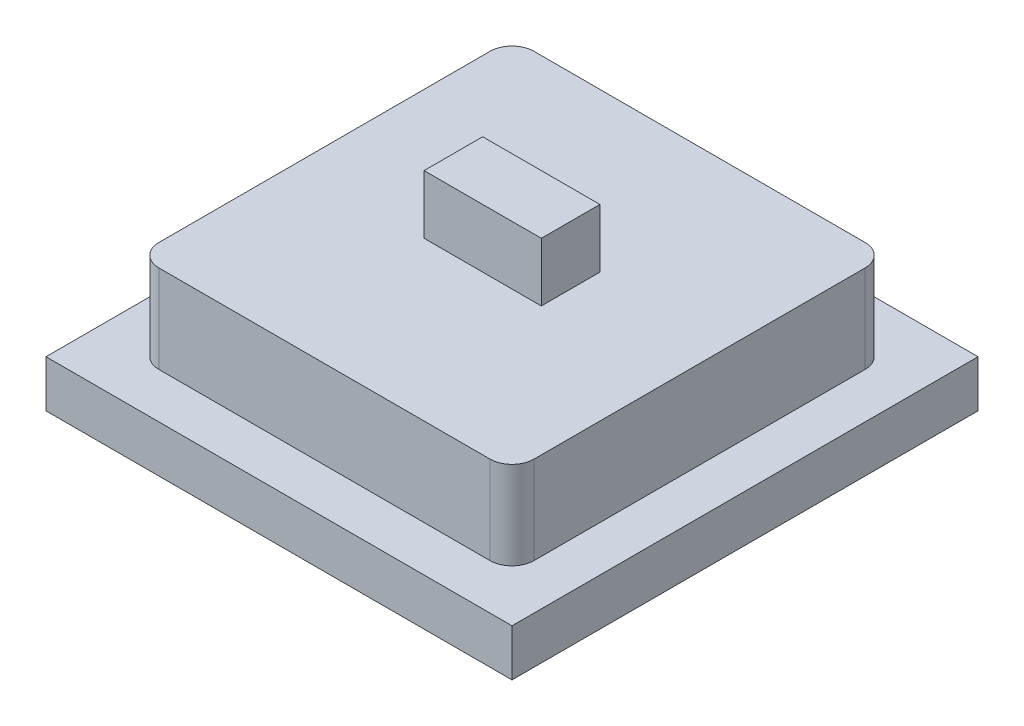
ISO-10303-21;
HEADER;
FILE_DESCRIPTION(('STEP AP214'),'2;1');
FILE_NAME('part.step','',(''),(''),'','','');
FILE_SCHEMA(('AUTOMOTIVE_DESIGN { 1 0 10303 214 1 1 1 1 }'));
ENDSEC;
DATA;
#1=APPLICATION_CONTEXT('core data for automotive mechanical design processes');
#2=APPLICATION_PROTOCOL_DEFINITION('international standard','automotive_design',2000,#1);
#3=PRODUCT_CONTEXT('',#1,'mechanical');
#4=PRODUCT('Part','Part','',(#3));
#5=PRODUCT_RELATED_PRODUCT_CATEGORY('part','',(#4));
#6=PRODUCT_DEFINITION_FORMATION('','',#4);
#7=PRODUCT_DEFINITION_CONTEXT('part definition',#1,'design');
#8=PRODUCT_DEFINITION('design','',#6,#7);
#9=PRODUCT_DEFINITION_SHAPE('','',#8);
#10=(LENGTH_UNIT() NAMED_UNIT(*) SI_UNIT(.MILLI.,.METRE.));
#11=(NAMED_UNIT(*) PLANE_ANGLE_UNIT() SI_UNIT($,.RADIAN.));
#12=(NAMED_UNIT(*) SI_UNIT($,.STERADIAN.) SOLID_ANGLE_UNIT());
#13=UNCERTAINTY_MEASURE_WITH_UNIT(LENGTH_MEASURE(1.E-05),#10,'distance_accuracy_value','');
#14=(GEOMETRIC_REPRESENTATION_CONTEXT(3) GLOBAL_UNCERTAINTY_ASSIGNED_CONTEXT((#13)) GLOBAL_UNIT_ASSIGNED_CONTEXT((#10,
#11,#12)) REPRESENTATION_CONTEXT('',''));
#15=CARTESIAN_POINT('',(0.,0.,0.));
#16=DIRECTION('',(0.,0.,1.));
#17=DIRECTION('',(1.,0.,0.));
#18=AXIS2_PLACEMENT_3D('',#15,#16,#17);
#19=CARTESIAN_POINT('',(-5.65,3.,-5.65));
#20=DIRECTION('',(0.,-1.,0.));
#21=DIRECTION('',(0.,0.,-1.));
#22=AXIS2_PLACEMENT_3D('',#19,#20,#21);
#23=PLANE('',#22);
#24=CARTESIAN_POINT('',(-5.65,3.,-5.65));
#25=DIRECTION('',(0.,1.,0.));
#26=DIRECTION('',(0.,0.,-1.));
#27=AXIS2_PLACEMENT_3D('',#24,#25,#26);
#28=CIRCLE('',#27,0.750000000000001);
#29=CARTESIAN_POINT('',(-5.65,3.,-6.4));
#30=VERTEX_POINT('',#29);
#31=CARTESIAN_POINT('',(-6.4,3.,-5.65));
#32=VERTEX_POINT('',#31);
#33=EDGE_CURVE('E202',#30,#32,#28,.T.);
#34=ORIENTED_EDGE('',*,*,#33,.T.);
#35=DIRECTION('',(0.,0.,1.));
#36=VECTOR('',#35,1.);
#37=CARTESIAN_POINT('',(-6.4,3.,5.65));
#38=LINE('',#37,#36);
#39=CARTESIAN_POINT('',(-6.4,3.,5.65));
#40=VERTEX_POINT('',#39);
#41=EDGE_CURVE('E205',#32,#40,#38,.T.);
#42=ORIENTED_EDGE('',*,*,#41,.T.);
#43=CARTESIAN_POINT('',(-5.65,3.,5.65));
#44=DIRECTION('',(0.,1.,0.));
#45=DIRECTION('',(0.,0.,-1.));
#46=AXIS2_PLACEMENT_3D('',#43,#44,#45);
#47=CIRCLE('',#46,0.750000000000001);
#48=CARTESIAN_POINT('',(-5.65,3.,6.4));
#49=VERTEX_POINT('',#48);
#50=EDGE_CURVE('E208',#40,#49,#47,.T.);
#51=ORIENTED_EDGE('',*,*,#50,.T.);
#52=DIRECTION('',(1.,0.,0.));
#53=VECTOR('',#52,1.);
#54=CARTESIAN_POINT('',(-5.65,3.,6.4));
#55=LINE('',#54,#53);
#56=CARTESIAN_POINT('',(5.65,3.,6.4));
#57=VERTEX_POINT('',#56);
#58=EDGE_CURVE('E210',#49,#57,#55,.T.);
#59=ORIENTED_EDGE('',*,*,#58,.T.);
#60=CARTESIAN_POINT('',(5.65,3.,5.65));
#61=DIRECTION('',(0.,1.,0.));
#62=DIRECTION('',(0.,0.,1.));
#63=AXIS2_PLACEMENT_3D('',#60,#61,#62);
#64=CIRCLE('',#63,0.750000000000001);
#65=CARTESIAN_POINT('',(6.4,3.,5.65));
#66=VERTEX_POINT('',#65);
#67=EDGE_CURVE('E212',#57,#66,#64,.T.);
#68=ORIENTED_EDGE('',*,*,#67,.T.);
#69=DIRECTION('',(0.,0.,-1.));
#70=VECTOR('',#69,1.);
#71=CARTESIAN_POINT('',(6.4,3.,5.65));
#72=LINE('',#71,#70);
#73=CARTESIAN_POINT('',(6.4,3.,-5.65));
#74=VERTEX_POINT('',#73);
#75=EDGE_CURVE('E214',#66,#74,#72,.T.);
#76=ORIENTED_EDGE('',*,*,#75,.T.);
#77=CARTESIAN_POINT('',(5.65,3.,-5.65));
#78=DIRECTION('',(0.,1.,0.));
#79=DIRECTION('',(0.,0.,-1.));
#80=AXIS2_PLACEMENT_3D('',#77,#78,#79);
#81=CIRCLE('',#80,0.750000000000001);
#82=CARTESIAN_POINT('',(5.65,3.,-6.4));
#83=VERTEX_POINT('',#82);
#84=EDGE_CURVE('E216',#74,#83,#81,.T.);
#85=ORIENTED_EDGE('',*,*,#84,.T.);
#86=DIRECTION('',(-1.,0.,0.));
#87=VECTOR('',#86,1.);
#88=CARTESIAN_POINT('',(-5.65,3.,-6.4));
#89=LINE('',#88,#87);
#90=EDGE_CURVE('E218',#83,#30,#89,.T.);
#91=ORIENTED_EDGE('',*,*,#90,.T.);
#92=EDGE_LOOP('',(#34,#42,#51,#59,#68,#76,#85,#91));
#93=FACE_BOUND('',#92,.T.);
#94=DIRECTION('',(0.,0.,1.));
#95=VECTOR('',#94,1.);
#96=CARTESIAN_POINT('',(-2.,3.,1.));
#97=LINE('',#96,#95);
#98=CARTESIAN_POINT('',(-2.,3.,-1.));
#99=VERTEX_POINT('',#98);
#100=CARTESIAN_POINT('',(-2.,3.,1.));
#101=VERTEX_POINT('',#100);
#102=EDGE_CURVE('E48',#99,#101,#97,.T.);
#103=ORIENTED_EDGE('',*,*,#102,.F.);
#104=DIRECTION('',(-1.,0.,0.));
#105=VECTOR('',#104,1.);
#106=CARTESIAN_POINT('',(2.,3.,-1.));
#107=LINE('',#106,#105);
#108=CARTESIAN_POINT('',(2.,3.,-1.));
#109=VERTEX_POINT('',#108);
#110=EDGE_CURVE('E52',#109,#99,#107,.T.);
#111=ORIENTED_EDGE('',*,*,#110,.F.);
#112=DIRECTION('',(0.,0.,-1.));
#113=VECTOR('',#112,1.);
#114=CARTESIAN_POINT('',(2.,3.,1.));
#115=LINE('',#114,#113);
#116=CARTESIAN_POINT('',(2.,3.,1.));
#117=VERTEX_POINT('',#116);
#118=EDGE_CURVE('E479',#117,#109,#115,.T.);
#119=ORIENTED_EDGE('',*,*,#118,.F.);
#120=DIRECTION('',(1.,0.,0.));
#121=VECTOR('',#120,1.);
#122=CARTESIAN_POINT('',(2.,3.,1.));
#123=LINE('',#122,#121);
#124=EDGE_CURVE('E485',#101,#117,#123,.T.);
#125=ORIENTED_EDGE('',*,*,#124,.F.);
#126=EDGE_LOOP('',(#103,#111,#119,#125));
#127=FACE_BOUND('',#126,.T.);
#128=ADVANCED_FACE('F33',(#93,#127),#23,.F.);
#129=CARTESIAN_POINT('',(-5.65,3.,-5.65));
#130=DIRECTION('',(0.,-1.,0.));
#131=DIRECTION('',(0.,0.,-1.));
#132=AXIS2_PLACEMENT_3D('',#129,#130,#131);
#133=CYLINDRICAL_SURFACE('',#132,0.750000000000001);
#134=CARTESIAN_POINT('',(-5.65,0.,-5.65));
#135=DIRECTION('',(0.,1.,0.));
#136=DIRECTION('',(0.,0.,-1.));
#137=AXIS2_PLACEMENT_3D('',#134,#135,#136);
#138=CIRCLE('',#137,0.750000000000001);
#139=CARTESIAN_POINT('',(-5.65,0.,-6.4));
#140=VERTEX_POINT('',#139);
#141=CARTESIAN_POINT('',(-6.4,0.,-5.65));
#142=VERTEX_POINT('',#141);
#143=EDGE_CURVE('E201',#140,#142,#138,.T.);
#144=ORIENTED_EDGE('',*,*,#143,.T.);
#145=DIRECTION('',(0.,-1.,0.));
#146=VECTOR('',#145,1.);
#147=CARTESIAN_POINT('',(-6.4,3.,-5.65));
#148=LINE('',#147,#146);
#149=EDGE_CURVE('E11',#32,#142,#148,.T.);
#150=ORIENTED_EDGE('',*,*,#149,.F.);
#151=ORIENTED_EDGE('',*,*,#33,.F.);
#152=DIRECTION('',(0.,-1.,0.));
#153=VECTOR('',#152,1.);
#154=CARTESIAN_POINT('',(-5.65,3.,-6.4));
#155=LINE('',#154,#153);
#156=EDGE_CURVE('E220',#30,#140,#155,.T.);
#157=ORIENTED_EDGE('',*,*,#156,.T.);
#158=EDGE_LOOP('',(#144,#150,#151,#157));
#159=FACE_BOUND('',#158,.T.);
#160=ADVANCED_FACE('F35',(#159),#133,.T.);
#161=CARTESIAN_POINT('',(-6.4,3.,5.65));
#162=DIRECTION('',(1.,0.,0.));
#163=DIRECTION('',(0.,0.,-1.));
#164=AXIS2_PLACEMENT_3D('',#161,#162,#163);
#165=PLANE('',#164);
#166=DIRECTION('',(0.,0.,1.));
#167=VECTOR('',#166,1.);
#168=CARTESIAN_POINT('',(-6.4,0.,5.65));
#169=LINE('',#168,#167);
#170=CARTESIAN_POINT('',(-6.4,0.,5.65));
#171=VERTEX_POINT('',#170);
#172=EDGE_CURVE('E223',#142,#171,#169,.T.);
#173=ORIENTED_EDGE('',*,*,#172,.T.);
#174=DIRECTION('',(0.,-1.,0.));
#175=VECTOR('',#174,1.);
#176=CARTESIAN_POINT('',(-6.4,3.,5.65));
#177=LINE('',#176,#175);
#178=EDGE_CURVE('E41',#40,#171,#177,.T.);
#179=ORIENTED_EDGE('',*,*,#178,.F.);
#180=ORIENTED_EDGE('',*,*,#41,.F.);
#181=ORIENTED_EDGE('',*,*,#149,.T.);
#182=EDGE_LOOP('',(#173,#179,#180,#181));
#183=FACE_BOUND('',#182,.T.);
#184=ADVANCED_FACE('F266',(#183),#165,.F.);
#185=CARTESIAN_POINT('',(-5.65,3.,5.65));
#186=DIRECTION('',(0.,-1.,0.));
#187=DIRECTION('',(0.,0.,-1.));
#188=AXIS2_PLACEMENT_3D('',#185,#186,#187);
#189=CYLINDRICAL_SURFACE('',#188,0.750000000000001);
#190=CARTESIAN_POINT('',(-5.65,0.,5.65));
#191=DIRECTION('',(0.,1.,0.));
#192=DIRECTION('',(0.,0.,-1.));
#193=AXIS2_PLACEMENT_3D('',#190,#191,#192);
#194=CIRCLE('',#193,0.750000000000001);
#195=CARTESIAN_POINT('',(-5.65,0.,6.4));
#196=VERTEX_POINT('',#195);
#197=EDGE_CURVE('E226',#171,#196,#194,.T.);
#198=ORIENTED_EDGE('',*,*,#197,.T.);
#199=DIRECTION('',(0.,-1.,0.));
#200=VECTOR('',#199,1.);
#201=CARTESIAN_POINT('',(-5.65,3.,6.4));
#202=LINE('',#201,#200);
#203=EDGE_CURVE('E257',#49,#196,#202,.T.);
#204=ORIENTED_EDGE('',*,*,#203,.F.);
#205=ORIENTED_EDGE('',*,*,#50,.F.);
#206=ORIENTED_EDGE('',*,*,#178,.T.);
#207=EDGE_LOOP('',(#198,#204,#205,#206));
#208=FACE_BOUND('',#207,.T.);
#209=ADVANCED_FACE('F263',(#208),#189,.T.);
#210=CARTESIAN_POINT('',(-5.65,3.,6.4));
#211=DIRECTION('',(0.,0.,-1.));
#212=DIRECTION('',(-1.,0.,0.));
#213=AXIS2_PLACEMENT_3D('',#210,#211,#212);
#214=PLANE('',#213);
#215=DIRECTION('',(1.,0.,0.));
#216=VECTOR('',#215,1.);
#217=CARTESIAN_POINT('',(-5.65,0.,6.4));
#218=LINE('',#217,#216);
#219=CARTESIAN_POINT('',(5.65,0.,6.4));
#220=VERTEX_POINT('',#219);
#221=EDGE_CURVE('E229',#196,#220,#218,.T.);
#222=ORIENTED_EDGE('',*,*,#221,.T.);
#223=DIRECTION('',(0.,-1.,0.));
#224=VECTOR('',#223,1.);
#225=CARTESIAN_POINT('',(5.65,3.,6.4));
#226=LINE('',#225,#224);
#227=EDGE_CURVE('E254',#57,#220,#226,.T.);
#228=ORIENTED_EDGE('',*,*,#227,.F.);
#229=ORIENTED_EDGE('',*,*,#58,.F.);
#230=ORIENTED_EDGE('',*,*,#203,.T.);
#231=EDGE_LOOP('',(#222,#228,#229,#230));
#232=FACE_BOUND('',#231,.T.);
#233=ADVANCED_FACE('F272',(#232),#214,.F.);
#234=CARTESIAN_POINT('',(5.65,3.,5.65));
#235=DIRECTION('',(0.,-1.,0.));
#236=DIRECTION('',(0.,0.,-1.));
#237=AXIS2_PLACEMENT_3D('',#234,#235,#236);
#238=CYLINDRICAL_SURFACE('',#237,0.750000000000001);
#239=CARTESIAN_POINT('',(5.65,0.,5.65));
#240=DIRECTION('',(0.,1.,0.));
#241=DIRECTION('',(0.,0.,1.));
#242=AXIS2_PLACEMENT_3D('',#239,#240,#241);
#243=CIRCLE('',#242,0.750000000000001);
#244=CARTESIAN_POINT('',(6.4,0.,5.65));
#245=VERTEX_POINT('',#244);
#246=EDGE_CURVE('E232',#220,#245,#243,.T.);
#247=ORIENTED_EDGE('',*,*,#246,.T.);
#248=DIRECTION('',(0.,-1.,0.));
#249=VECTOR('',#248,1.);
#250=CARTESIAN_POINT('',(6.4,3.,5.65));
#251=LINE('',#250,#249);
#252=EDGE_CURVE('E251',#66,#245,#251,.T.);
#253=ORIENTED_EDGE('',*,*,#252,.F.);
#254=ORIENTED_EDGE('',*,*,#67,.F.);
#255=ORIENTED_EDGE('',*,*,#227,.T.);
#256=EDGE_LOOP('',(#247,#253,#254,#255));
#257=FACE_BOUND('',#256,.T.);
#258=ADVANCED_FACE('F276',(#257),#238,.T.);
#259=CARTESIAN_POINT('',(6.4,3.,5.65));
#260=DIRECTION('',(-1.,0.,0.));
#261=DIRECTION('',(0.,0.,1.));
#262=AXIS2_PLACEMENT_3D('',#259,#260,#261);
#263=PLANE('',#262);
#264=DIRECTION('',(0.,0.,-1.));
#265=VECTOR('',#264,1.);
#266=CARTESIAN_POINT('',(6.4,0.,5.65));
#267=LINE('',#266,#265);
#268=CARTESIAN_POINT('',(6.4,0.,-5.65));
#269=VERTEX_POINT('',#268);
#270=EDGE_CURVE('E235',#245,#269,#267,.T.);
#271=ORIENTED_EDGE('',*,*,#270,.T.);
#272=DIRECTION('',(0.,-1.,0.));
#273=VECTOR('',#272,1.);
#274=CARTESIAN_POINT('',(6.4,3.,-5.65));
#275=LINE('',#274,#273);
#276=EDGE_CURVE('E248',#74,#269,#275,.T.);
#277=ORIENTED_EDGE('',*,*,#276,.F.);
#278=ORIENTED_EDGE('',*,*,#75,.F.);
#279=ORIENTED_EDGE('',*,*,#252,.T.);
#280=EDGE_LOOP('',(#271,#277,#278,#279));
#281=FACE_BOUND('',#280,.T.);
#282=ADVANCED_FACE('F292',(#281),#263,.F.);
#283=CARTESIAN_POINT('',(5.65,3.,-5.65));
#284=DIRECTION('',(0.,-1.,0.));
#285=DIRECTION('',(0.,0.,-1.));
#286=AXIS2_PLACEMENT_3D('',#283,#284,#285);
#287=CYLINDRICAL_SURFACE('',#286,0.750000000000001);
#288=CARTESIAN_POINT('',(5.65,0.,-5.65));
#289=DIRECTION('',(0.,1.,0.));
#290=DIRECTION('',(0.,0.,-1.));
#291=AXIS2_PLACEMENT_3D('',#288,#289,#290);
#292=CIRCLE('',#291,0.750000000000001);
#293=CARTESIAN_POINT('',(5.65,0.,-6.4));
#294=VERTEX_POINT('',#293);
#295=EDGE_CURVE('E238',#269,#294,#292,.T.);
#296=ORIENTED_EDGE('',*,*,#295,.T.);
#297=DIRECTION('',(0.,-1.,0.));
#298=VECTOR('',#297,1.);
#299=CARTESIAN_POINT('',(5.65,3.,-6.4));
#300=LINE('',#299,#298);
#301=EDGE_CURVE('E245',#83,#294,#300,.T.);
#302=ORIENTED_EDGE('',*,*,#301,.F.);
#303=ORIENTED_EDGE('',*,*,#84,.F.);
#304=ORIENTED_EDGE('',*,*,#276,.T.);
#305=EDGE_LOOP('',(#296,#302,#303,#304));
#306=FACE_BOUND('',#305,.T.);
#307=ADVANCED_FACE('F289',(#306),#287,.T.);
#308=CARTESIAN_POINT('',(-5.65,3.,-6.4));
#309=DIRECTION('',(0.,0.,1.));
#310=DIRECTION('',(1.,0.,0.));
#311=AXIS2_PLACEMENT_3D('',#308,#309,#310);
#312=PLANE('',#311);
#313=DIRECTION('',(-1.,0.,0.));
#314=VECTOR('',#313,1.);
#315=CARTESIAN_POINT('',(-5.65,0.,-6.4));
#316=LINE('',#315,#314);
#317=EDGE_CURVE('E206',#294,#140,#316,.T.);
#318=ORIENTED_EDGE('',*,*,#317,.T.);
#319=ORIENTED_EDGE('',*,*,#156,.F.);
#320=ORIENTED_EDGE('',*,*,#90,.F.);
#321=ORIENTED_EDGE('',*,*,#301,.T.);
#322=EDGE_LOOP('',(#318,#319,#320,#321));
#323=FACE_BOUND('',#322,.T.);
#324=ADVANCED_FACE('F286',(#323),#312,.F.);
#325=CARTESIAN_POINT('',(0.,0.,0.));
#326=DIRECTION('',(0.,1.,0.));
#327=DIRECTION('',(0.,0.,1.));
#328=AXIS2_PLACEMENT_3D('',#325,#326,#327);
#329=PLANE('',#328);
#330=DIRECTION('',(0.,0.,-1.));
#331=VECTOR('',#330,1.);
#332=CARTESIAN_POINT('',(-7.95,0.,7.95));
#333=LINE('',#332,#331);
#334=CARTESIAN_POINT('',(-7.95,0.,7.95));
#335=VERTEX_POINT('',#334);
#336=CARTESIAN_POINT('',(-7.95,0.,-7.95));
#337=VERTEX_POINT('',#336);
#338=EDGE_CURVE('E166',#335,#337,#333,.T.);
#339=ORIENTED_EDGE('',*,*,#338,.F.);
#340=DIRECTION('',(-1.,0.,0.));
#341=VECTOR('',#340,1.);
#342=CARTESIAN_POINT('',(7.95,0.,7.95));
#343=LINE('',#342,#341);
#344=CARTESIAN_POINT('',(7.95,0.,7.95));
#345=VERTEX_POINT('',#344);
#346=EDGE_CURVE('E179',#345,#335,#343,.T.);
#347=ORIENTED_EDGE('',*,*,#346,.F.);
#348=DIRECTION('',(0.,0.,1.));
#349=VECTOR('',#348,1.);
#350=CARTESIAN_POINT('',(7.95,0.,7.95));
#351=LINE('',#350,#349);
#352=CARTESIAN_POINT('',(7.95,0.,-7.95));
#353=VERTEX_POINT('',#352);
#354=EDGE_CURVE('E187',#353,#345,#351,.T.);
#355=ORIENTED_EDGE('',*,*,#354,.F.);
#356=DIRECTION('',(1.,0.,0.));
#357=VECTOR('',#356,1.);
#358=CARTESIAN_POINT('',(7.95,0.,-7.95));
#359=LINE('',#358,#357);
#360=EDGE_CURVE('E169',#337,#353,#359,.T.);
#361=ORIENTED_EDGE('',*,*,#360,.F.);
#362=EDGE_LOOP('',(#339,#347,#355,#361));
#363=FACE_BOUND('',#362,.T.);
#364=ORIENTED_EDGE('',*,*,#143,.F.);
#365=ORIENTED_EDGE('',*,*,#317,.F.);
#366=ORIENTED_EDGE('',*,*,#295,.F.);
#367=ORIENTED_EDGE('',*,*,#270,.F.);
#368=ORIENTED_EDGE('',*,*,#246,.F.);
#369=ORIENTED_EDGE('',*,*,#221,.F.);
#370=ORIENTED_EDGE('',*,*,#197,.F.);
#371=ORIENTED_EDGE('',*,*,#172,.F.);
#372=EDGE_LOOP('',(#364,#365,#366,#367,#368,#369,#370,#371));
#373=FACE_BOUND('',#372,.T.);
#374=ADVANCED_FACE('F269',(#363,#373),#329,.T.);
#375=CARTESIAN_POINT('',(-7.95,-1.6,7.95));
#376=DIRECTION('',(1.,0.,0.));
#377=DIRECTION('',(0.,0.,-1.));
#378=AXIS2_PLACEMENT_3D('',#375,#376,#377);
#379=PLANE('',#378);
#380=ORIENTED_EDGE('',*,*,#338,.T.);
#381=DIRECTION('',(0.,1.,0.));
#382=VECTOR('',#381,1.);
#383=CARTESIAN_POINT('',(-7.95,-1.6,-7.95));
#384=LINE('',#383,#382);
#385=CARTESIAN_POINT('',(-7.95,-1.6,-7.95));
#386=VERTEX_POINT('',#385);
#387=EDGE_CURVE('E198',#386,#337,#384,.T.);
#388=ORIENTED_EDGE('',*,*,#387,.F.);
#389=DIRECTION('',(0.,0.,-1.));
#390=VECTOR('',#389,1.);
#391=CARTESIAN_POINT('',(-7.95,-1.6,7.95));
#392=LINE('',#391,#390);
#393=CARTESIAN_POINT('',(-7.95,-1.6,7.95));
#394=VERTEX_POINT('',#393);
#395=EDGE_CURVE('E175',#394,#386,#392,.T.);
#396=ORIENTED_EDGE('',*,*,#395,.F.);
#397=DIRECTION('',(0.,1.,0.));
#398=VECTOR('',#397,1.);
#399=CARTESIAN_POINT('',(-7.95,-1.6,7.95));
#400=LINE('',#399,#398);
#401=EDGE_CURVE('E184',#394,#335,#400,.T.);
#402=ORIENTED_EDGE('',*,*,#401,.T.);
#403=EDGE_LOOP('',(#380,#388,#396,#402));
#404=FACE_BOUND('',#403,.T.);
#405=ADVANCED_FACE('F308',(#404),#379,.F.);
#406=CARTESIAN_POINT('',(7.95,-1.6,-7.95));
#407=DIRECTION('',(0.,0.,1.));
#408=DIRECTION('',(1.,0.,0.));
#409=AXIS2_PLACEMENT_3D('',#406,#407,#408);
#410=PLANE('',#409);
#411=ORIENTED_EDGE('',*,*,#360,.T.);
#412=DIRECTION('',(0.,1.,0.));
#413=VECTOR('',#412,1.);
#414=CARTESIAN_POINT('',(7.95,-1.6,-7.95));
#415=LINE('',#414,#413);
#416=CARTESIAN_POINT('',(7.95,-1.6,-7.95));
#417=VERTEX_POINT('',#416);
#418=EDGE_CURVE('E195',#417,#353,#415,.T.);
#419=ORIENTED_EDGE('',*,*,#418,.F.);
#420=DIRECTION('',(1.,0.,0.));
#421=VECTOR('',#420,1.);
#422=CARTESIAN_POINT('',(7.95,-1.6,-7.95));
#423=LINE('',#422,#421);
#424=EDGE_CURVE('E178',#386,#417,#423,.T.);
#425=ORIENTED_EDGE('',*,*,#424,.F.);
#426=ORIENTED_EDGE('',*,*,#387,.T.);
#427=EDGE_LOOP('',(#411,#419,#425,#426));
#428=FACE_BOUND('',#427,.T.);
#429=ADVANCED_FACE('F319',(#428),#410,.F.);
#430=CARTESIAN_POINT('',(7.95,-1.6,7.95));
#431=DIRECTION('',(-1.,0.,0.));
#432=DIRECTION('',(0.,0.,1.));
#433=AXIS2_PLACEMENT_3D('',#430,#431,#432);
#434=PLANE('',#433);
#435=ORIENTED_EDGE('',*,*,#354,.T.);
#436=DIRECTION('',(0.,1.,0.));
#437=VECTOR('',#436,1.);
#438=CARTESIAN_POINT('',(7.95,-1.6,7.95));
#439=LINE('',#438,#437);
#440=CARTESIAN_POINT('',(7.95,-1.6,7.95));
#441=VERTEX_POINT('',#440);
#442=EDGE_CURVE('E192',#441,#345,#439,.T.);
#443=ORIENTED_EDGE('',*,*,#442,.F.);
#444=DIRECTION('',(0.,0.,1.));
#445=VECTOR('',#444,1.);
#446=CARTESIAN_POINT('',(7.95,-1.6,7.95));
#447=LINE('',#446,#445);
#448=EDGE_CURVE('E181',#417,#441,#447,.T.);
#449=ORIENTED_EDGE('',*,*,#448,.F.);
#450=ORIENTED_EDGE('',*,*,#418,.T.);
#451=EDGE_LOOP('',(#435,#443,#449,#450));
#452=FACE_BOUND('',#451,.T.);
#453=ADVANCED_FACE('F329',(#452),#434,.F.);
#454=CARTESIAN_POINT('',(7.95,-1.6,7.95));
#455=DIRECTION('',(0.,0.,-1.));
#456=DIRECTION('',(-1.,0.,0.));
#457=AXIS2_PLACEMENT_3D('',#454,#455,#456);
#458=PLANE('',#457);
#459=ORIENTED_EDGE('',*,*,#346,.T.);
#460=ORIENTED_EDGE('',*,*,#401,.F.);
#461=DIRECTION('',(-1.,0.,0.));
#462=VECTOR('',#461,1.);
#463=CARTESIAN_POINT('',(7.95,-1.6,7.95));
#464=LINE('',#463,#462);
#465=EDGE_CURVE('E183',#441,#394,#464,.T.);
#466=ORIENTED_EDGE('',*,*,#465,.F.);
#467=ORIENTED_EDGE('',*,*,#442,.T.);
#468=EDGE_LOOP('',(#459,#460,#466,#467));
#469=FACE_BOUND('',#468,.T.);
#470=ADVANCED_FACE('F326',(#469),#458,.F.);
#471=CARTESIAN_POINT('',(0.,-1.6,0.));
#472=DIRECTION('',(0.,1.,0.));
#473=DIRECTION('',(0.,0.,1.));
#474=AXIS2_PLACEMENT_3D('',#471,#472,#473);
#475=PLANE('',#474);
#476=ORIENTED_EDGE('',*,*,#395,.T.);
#477=ORIENTED_EDGE('',*,*,#424,.T.);
#478=ORIENTED_EDGE('',*,*,#448,.T.);
#479=ORIENTED_EDGE('',*,*,#465,.T.);
#480=EDGE_LOOP('',(#476,#477,#478,#479));
#481=FACE_BOUND('',#480,.T.);
#482=ADVANCED_FACE('F324',(#481),#475,.F.);
#483=CARTESIAN_POINT('',(-2.,5.,1.));
#484=DIRECTION('',(1.,0.,0.));
#485=DIRECTION('',(0.,0.,-1.));
#486=AXIS2_PLACEMENT_3D('',#483,#484,#485);
#487=PLANE('',#486);
#488=ORIENTED_EDGE('',*,*,#102,.T.);
#489=DIRECTION('',(0.,-1.,0.));
#490=VECTOR('',#489,1.);
#491=CARTESIAN_POINT('',(-2.,5.,1.));
#492=LINE('',#491,#490);
#493=CARTESIAN_POINT('',(-2.,5.,1.));
#494=VERTEX_POINT('',#493);
#495=EDGE_CURVE('E149',#494,#101,#492,.T.);
#496=ORIENTED_EDGE('',*,*,#495,.F.);
#497=DIRECTION('',(0.,0.,1.));
#498=VECTOR('',#497,1.);
#499=CARTESIAN_POINT('',(-2.,5.,1.));
#500=LINE('',#499,#498);
#501=CARTESIAN_POINT('',(-2.,5.,-1.));
#502=VERTEX_POINT('',#501);
#503=EDGE_CURVE('E155',#502,#494,#500,.T.);
#504=ORIENTED_EDGE('',*,*,#503,.F.);
#505=DIRECTION('',(0.,-1.,0.));
#506=VECTOR('',#505,1.);
#507=CARTESIAN_POINT('',(-2.,5.,-1.));
#508=LINE('',#507,#506);
#509=EDGE_CURVE('E477',#502,#99,#508,.T.);
#510=ORIENTED_EDGE('',*,*,#509,.T.);
#511=EDGE_LOOP('',(#488,#496,#504,#510));
#512=FACE_BOUND('',#511,.T.);
#513=ADVANCED_FACE('F165',(#512),#487,.F.);
#514=CARTESIAN_POINT('',(2.,5.,1.));
#515=DIRECTION('',(0.,0.,-1.));
#516=DIRECTION('',(-1.,0.,0.));
#517=AXIS2_PLACEMENT_3D('',#514,#515,#516);
#518=PLANE('',#517);
#519=ORIENTED_EDGE('',*,*,#124,.T.);
#520=DIRECTION('',(0.,-1.,0.));
#521=VECTOR('',#520,1.);
#522=CARTESIAN_POINT('',(2.,5.,1.));
#523=LINE('',#522,#521);
#524=CARTESIAN_POINT('',(2.,5.,1.));
#525=VERTEX_POINT('',#524);
#526=EDGE_CURVE('E151',#525,#117,#523,.T.);
#527=ORIENTED_EDGE('',*,*,#526,.F.);
#528=DIRECTION('',(1.,0.,0.));
#529=VECTOR('',#528,1.);
#530=CARTESIAN_POINT('',(2.,5.,1.));
#531=LINE('',#530,#529);
#532=EDGE_CURVE('E144',#494,#525,#531,.T.);
#533=ORIENTED_EDGE('',*,*,#532,.F.);
#534=ORIENTED_EDGE('',*,*,#495,.T.);
#535=EDGE_LOOP('',(#519,#527,#533,#534));
#536=FACE_BOUND('',#535,.T.);
#537=ADVANCED_FACE('F147',(#536),#518,.F.);
#538=CARTESIAN_POINT('',(2.,5.,1.));
#539=DIRECTION('',(-1.,0.,0.));
#540=DIRECTION('',(0.,0.,1.));
#541=AXIS2_PLACEMENT_3D('',#538,#539,#540);
#542=PLANE('',#541);
#543=ORIENTED_EDGE('',*,*,#118,.T.);
#544=DIRECTION('',(0.,-1.,0.));
#545=VECTOR('',#544,1.);
#546=CARTESIAN_POINT('',(2.,5.,-1.));
#547=LINE('',#546,#545);
#548=CARTESIAN_POINT('',(2.,5.,-1.));
#549=VERTEX_POINT('',#548);
#550=EDGE_CURVE('E171',#549,#109,#547,.T.);
#551=ORIENTED_EDGE('',*,*,#550,.F.);
#552=DIRECTION('',(0.,0.,-1.));
#553=VECTOR('',#552,1.);
#554=CARTESIAN_POINT('',(2.,5.,1.));
#555=LINE('',#554,#553);
#556=EDGE_CURVE('E154',#525,#549,#555,.T.);
#557=ORIENTED_EDGE('',*,*,#556,.F.);
#558=ORIENTED_EDGE('',*,*,#526,.T.);
#559=EDGE_LOOP('',(#543,#551,#557,#558));
#560=FACE_BOUND('',#559,.T.);
#561=ADVANCED_FACE('F354',(#560),#542,.F.);
#562=CARTESIAN_POINT('',(2.,5.,-1.));
#563=DIRECTION('',(0.,0.,1.));
#564=DIRECTION('',(1.,0.,0.));
#565=AXIS2_PLACEMENT_3D('',#562,#563,#564);
#566=PLANE('',#565);
#567=ORIENTED_EDGE('',*,*,#110,.T.);
#568=ORIENTED_EDGE('',*,*,#509,.F.);
#569=DIRECTION('',(-1.,0.,0.));
#570=VECTOR('',#569,1.);
#571=CARTESIAN_POINT('',(2.,5.,-1.));
#572=LINE('',#571,#570);
#573=EDGE_CURVE('E160',#549,#502,#572,.T.);
#574=ORIENTED_EDGE('',*,*,#573,.F.);
#575=ORIENTED_EDGE('',*,*,#550,.T.);
#576=EDGE_LOOP('',(#567,#568,#574,#575));
#577=FACE_BOUND('',#576,.T.);
#578=ADVANCED_FACE('F359',(#577),#566,.F.);
#579=CARTESIAN_POINT('',(0.,5.,0.));
#580=DIRECTION('',(0.,1.,0.));
#581=DIRECTION('',(0.,0.,1.));
#582=AXIS2_PLACEMENT_3D('',#579,#580,#581);
#583=PLANE('',#582);
#584=ORIENTED_EDGE('',*,*,#503,.T.);
#585=ORIENTED_EDGE('',*,*,#532,.T.);
#586=ORIENTED_EDGE('',*,*,#556,.T.);
#587=ORIENTED_EDGE('',*,*,#573,.T.);
#588=EDGE_LOOP('',(#584,#585,#586,#587));
#589=FACE_BOUND('',#588,.T.);
#590=ADVANCED_FACE('F158',(#589),#583,.T.);
#591=CLOSED_SHELL('',(#128,#160,#184,#209,#233,#258,#282,#307,#324,#374,#405,#429,#453,#470,
#482,#513,#537,#561,#578,#590));
#592=MANIFOLD_SOLID_BREP('B2',#591);
#593=ADVANCED_BREP_SHAPE_REPRESENTATION('',(#18,#592),#14);
#594=SHAPE_DEFINITION_REPRESENTATION(#9,#593);
ENDSEC;
END-ISO-10303-21;
